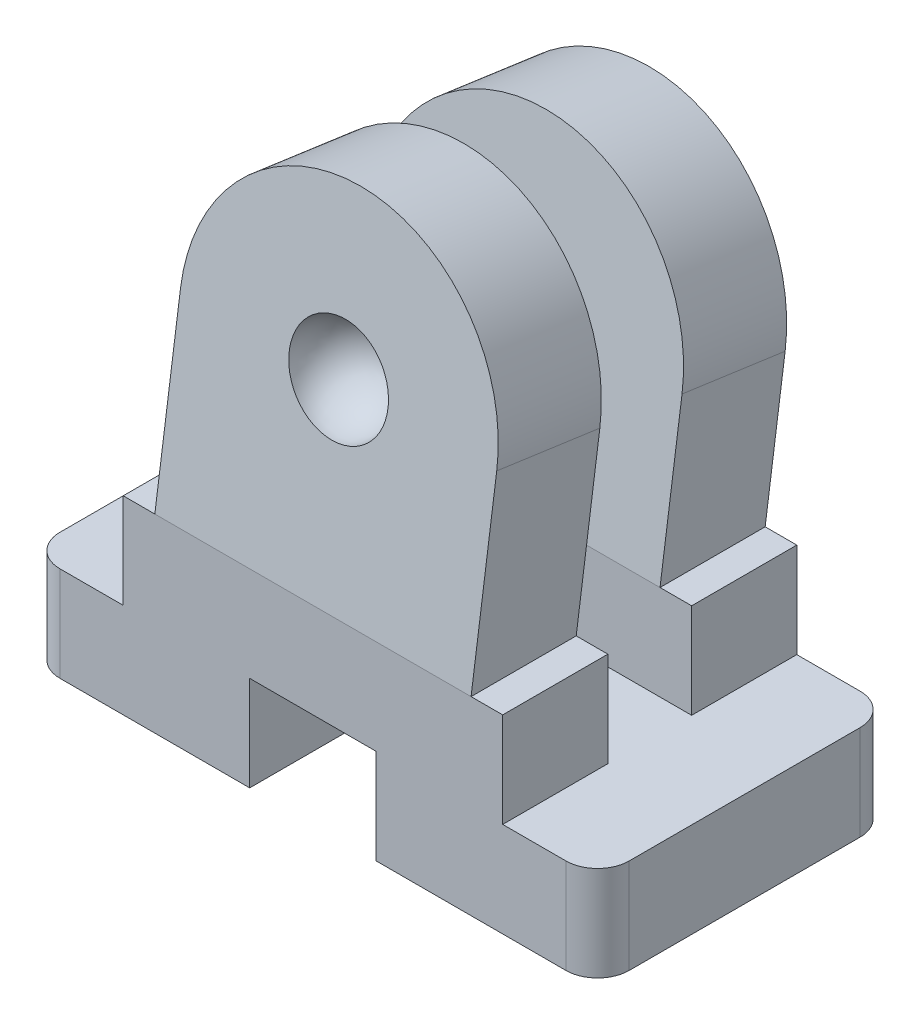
ISO-10303-21;
HEADER;
FILE_DESCRIPTION(('STEP AP214'),'2;1');
FILE_NAME('part.step','',(''),(''),'','','');
FILE_SCHEMA(('AUTOMOTIVE_DESIGN { 1 0 10303 214 1 1 1 1 }'));
ENDSEC;
DATA;
#1=APPLICATION_CONTEXT('core data for automotive mechanical design processes');
#2=APPLICATION_PROTOCOL_DEFINITION('international standard','automotive_design',2000,#1);
#3=PRODUCT_CONTEXT('',#1,'mechanical');
#4=PRODUCT('Part','Part','',(#3));
#5=PRODUCT_RELATED_PRODUCT_CATEGORY('part','',(#4));
#6=PRODUCT_DEFINITION_FORMATION('','',#4);
#7=PRODUCT_DEFINITION_CONTEXT('part definition',#1,'design');
#8=PRODUCT_DEFINITION('design','',#6,#7);
#9=PRODUCT_DEFINITION_SHAPE('','',#8);
#10=(LENGTH_UNIT() NAMED_UNIT(*) SI_UNIT(.MILLI.,.METRE.));
#11=(NAMED_UNIT(*) PLANE_ANGLE_UNIT() SI_UNIT($,.RADIAN.));
#12=(NAMED_UNIT(*) SI_UNIT($,.STERADIAN.) SOLID_ANGLE_UNIT());
#13=UNCERTAINTY_MEASURE_WITH_UNIT(LENGTH_MEASURE(1.E-05),#10,'distance_accuracy_value','');
#14=(GEOMETRIC_REPRESENTATION_CONTEXT(3) GLOBAL_UNCERTAINTY_ASSIGNED_CONTEXT((#13)) GLOBAL_UNIT_ASSIGNED_CONTEXT((#10,
#11,#12)) REPRESENTATION_CONTEXT('',''));
#15=CARTESIAN_POINT('',(0.,0.,0.));
#16=DIRECTION('',(0.,0.,1.));
#17=DIRECTION('',(1.,0.,0.));
#18=AXIS2_PLACEMENT_3D('',#15,#16,#17);
#19=CARTESIAN_POINT('',(0.,3.,0.));
#20=DIRECTION('',(0.,1.,0.));
#21=DIRECTION('',(0.,0.,1.));
#22=AXIS2_PLACEMENT_3D('',#19,#20,#21);
#23=PLANE('',#22);
#24=DIRECTION('',(0.,0.,-1.));
#25=VECTOR('',#24,1.);
#26=CARTESIAN_POINT('',(9.,3.,-4.65));
#27=LINE('',#26,#25);
#28=CARTESIAN_POINT('',(9.,3.,3.65));
#29=VERTEX_POINT('',#28);
#30=CARTESIAN_POINT('',(9.,3.,-3.65));
#31=VERTEX_POINT('',#30);
#32=EDGE_CURVE('E414',#29,#31,#27,.T.);
#33=ORIENTED_EDGE('',*,*,#32,.T.);
#34=CARTESIAN_POINT('',(8.,3.,-3.65));
#35=DIRECTION('',(0.,1.,0.));
#36=DIRECTION('',(0.,0.,1.));
#37=AXIS2_PLACEMENT_3D('',#34,#35,#36);
#38=CIRCLE('',#37,1.);
#39=CARTESIAN_POINT('',(8.,3.,-4.65));
#40=VERTEX_POINT('',#39);
#41=EDGE_CURVE('E12',#31,#40,#38,.T.);
#42=ORIENTED_EDGE('',*,*,#41,.T.);
#43=DIRECTION('',(-1.,0.,0.));
#44=VECTOR('',#43,1.);
#45=CARTESIAN_POINT('',(-9.,3.,-4.65));
#46=LINE('',#45,#44);
#47=CARTESIAN_POINT('',(6.,3.,-4.65));
#48=VERTEX_POINT('',#47);
#49=EDGE_CURVE('E424',#40,#48,#46,.T.);
#50=ORIENTED_EDGE('',*,*,#49,.T.);
#51=DIRECTION('',(0.,0.,-1.));
#52=VECTOR('',#51,1.);
#53=CARTESIAN_POINT('',(6.,3.,-4.65));
#54=LINE('',#53,#52);
#55=CARTESIAN_POINT('',(6.,3.,-1.325));
#56=VERTEX_POINT('',#55);
#57=EDGE_CURVE('E388',#56,#48,#54,.T.);
#58=ORIENTED_EDGE('',*,*,#57,.F.);
#59=DIRECTION('',(1.,0.,0.));
#60=VECTOR('',#59,1.);
#61=CARTESIAN_POINT('',(-6.,3.,-1.325));
#62=LINE('',#61,#60);
#63=CARTESIAN_POINT('',(2.,3.,-1.325));
#64=VERTEX_POINT('',#63);
#65=EDGE_CURVE('E397',#64,#56,#62,.T.);
#66=ORIENTED_EDGE('',*,*,#65,.F.);
#67=DIRECTION('',(0.,0.,1.));
#68=VECTOR('',#67,1.);
#69=CARTESIAN_POINT('',(2.,3.,4.65));
#70=LINE('',#69,#68);
#71=CARTESIAN_POINT('',(2.,3.,1.325));
#72=VERTEX_POINT('',#71);
#73=EDGE_CURVE('E242',#64,#72,#70,.T.);
#74=ORIENTED_EDGE('',*,*,#73,.T.);
#75=DIRECTION('',(-1.,0.,0.));
#76=VECTOR('',#75,1.);
#77=CARTESIAN_POINT('',(-6.,3.,1.325));
#78=LINE('',#77,#76);
#79=CARTESIAN_POINT('',(6.,3.,1.325));
#80=VERTEX_POINT('',#79);
#81=EDGE_CURVE('E516',#80,#72,#78,.T.);
#82=ORIENTED_EDGE('',*,*,#81,.F.);
#83=DIRECTION('',(0.,0.,-1.));
#84=VECTOR('',#83,1.);
#85=CARTESIAN_POINT('',(6.,3.,4.65));
#86=LINE('',#85,#84);
#87=CARTESIAN_POINT('',(6.,3.,4.65));
#88=VERTEX_POINT('',#87);
#89=EDGE_CURVE('E521',#88,#80,#86,.T.);
#90=ORIENTED_EDGE('',*,*,#89,.F.);
#91=DIRECTION('',(1.,0.,0.));
#92=VECTOR('',#91,1.);
#93=CARTESIAN_POINT('',(-9.,3.,4.65));
#94=LINE('',#93,#92);
#95=CARTESIAN_POINT('',(8.,3.,4.65));
#96=VERTEX_POINT('',#95);
#97=EDGE_CURVE('E411',#88,#96,#94,.T.);
#98=ORIENTED_EDGE('',*,*,#97,.T.);
#99=CARTESIAN_POINT('',(8.,3.,3.65));
#100=DIRECTION('',(0.,1.,0.));
#101=DIRECTION('',(0.,0.,1.));
#102=AXIS2_PLACEMENT_3D('',#99,#100,#101);
#103=CIRCLE('',#102,1.);
#104=EDGE_CURVE('E45',#96,#29,#103,.T.);
#105=ORIENTED_EDGE('',*,*,#104,.T.);
#106=EDGE_LOOP('',(#33,#42,#50,#58,#66,#74,#82,#90,#98,#105));
#107=FACE_BOUND('',#106,.T.);
#108=ADVANCED_FACE('F37',(#107),#23,.T.);
#109=CARTESIAN_POINT('',(0.,0.,0.));
#110=DIRECTION('',(0.,1.,0.));
#111=DIRECTION('',(0.,0.,1.));
#112=AXIS2_PLACEMENT_3D('',#109,#110,#111);
#113=PLANE('',#112);
#114=DIRECTION('',(-1.,0.,0.));
#115=VECTOR('',#114,1.);
#116=CARTESIAN_POINT('',(-9.,0.,-4.65));
#117=LINE('',#116,#115);
#118=CARTESIAN_POINT('',(8.,0.,-4.65));
#119=VERTEX_POINT('',#118);
#120=CARTESIAN_POINT('',(2.,0.,-4.65));
#121=VERTEX_POINT('',#120);
#122=EDGE_CURVE('E262',#119,#121,#117,.T.);
#123=ORIENTED_EDGE('',*,*,#122,.F.);
#124=CARTESIAN_POINT('',(8.,0.,-3.65));
#125=DIRECTION('',(0.,1.,0.));
#126=DIRECTION('',(0.,0.,1.));
#127=AXIS2_PLACEMENT_3D('',#124,#125,#126);
#128=CIRCLE('',#127,1.);
#129=CARTESIAN_POINT('',(9.,0.,-3.65));
#130=VERTEX_POINT('',#129);
#131=EDGE_CURVE('E444',#119,#130,#128,.F.);
#132=ORIENTED_EDGE('',*,*,#131,.T.);
#133=DIRECTION('',(0.,0.,-1.));
#134=VECTOR('',#133,1.);
#135=CARTESIAN_POINT('',(9.,0.,-4.65));
#136=LINE('',#135,#134);
#137=CARTESIAN_POINT('',(9.,0.,3.65));
#138=VERTEX_POINT('',#137);
#139=EDGE_CURVE('E452',#138,#130,#136,.T.);
#140=ORIENTED_EDGE('',*,*,#139,.F.);
#141=CARTESIAN_POINT('',(8.,0.,3.65));
#142=DIRECTION('',(0.,1.,0.));
#143=DIRECTION('',(0.,0.,1.));
#144=AXIS2_PLACEMENT_3D('',#141,#142,#143);
#145=CIRCLE('',#144,1.);
#146=CARTESIAN_POINT('',(8.,0.,4.65));
#147=VERTEX_POINT('',#146);
#148=EDGE_CURVE('E442',#138,#147,#145,.F.);
#149=ORIENTED_EDGE('',*,*,#148,.T.);
#150=DIRECTION('',(1.,0.,0.));
#151=VECTOR('',#150,1.);
#152=CARTESIAN_POINT('',(-9.,0.,4.65));
#153=LINE('',#152,#151);
#154=CARTESIAN_POINT('',(2.,0.,4.65));
#155=VERTEX_POINT('',#154);
#156=EDGE_CURVE('E461',#155,#147,#153,.T.);
#157=ORIENTED_EDGE('',*,*,#156,.F.);
#158=DIRECTION('',(0.,0.,1.));
#159=VECTOR('',#158,1.);
#160=CARTESIAN_POINT('',(2.,0.,4.65));
#161=LINE('',#160,#159);
#162=EDGE_CURVE('E256',#121,#155,#161,.T.);
#163=ORIENTED_EDGE('',*,*,#162,.F.);
#164=EDGE_LOOP('',(#123,#132,#140,#149,#157,#163));
#165=FACE_BOUND('',#164,.T.);
#166=ADVANCED_FACE('F455',(#165),#113,.F.);
#167=CARTESIAN_POINT('',(-5.,0.757071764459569,5.38684551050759));
#168=DIRECTION('',(0.,-0.139173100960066,-0.99026806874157));
#169=DIRECTION('',(0.,0.99026806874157,-0.139173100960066));
#170=AXIS2_PLACEMENT_3D('',#167,#168,#169);
#171=PLANE('',#170);
#172=CARTESIAN_POINT('',(0.,11.7748069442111,3.8384038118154));
#173=DIRECTION('',(0.,0.139173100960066,0.99026806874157));
#174=DIRECTION('',(0.,-0.99026806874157,0.139173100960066));
#175=AXIS2_PLACEMENT_3D('',#172,#173,#174);
#176=CIRCLE('',#175,1.5625);
#177=CARTESIAN_POINT('',(0.,10.2275130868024,4.0558617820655));
#178=VERTEX_POINT('',#177);
#179=EDGE_CURVE('E287',#178,#178,#176,.T.);
#180=ORIENTED_EDGE('',*,*,#179,.F.);
#181=EDGE_LOOP('',(#180));
#182=FACE_BOUND('',#181,.T.);
#183=DIRECTION('',(0.,0.99026806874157,-0.139173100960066));
#184=VECTOR('',#183,1.);
#185=CARTESIAN_POINT('',(5.,0.757071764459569,5.38684551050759));
#186=LINE('',#185,#184);
#187=CARTESIAN_POINT('',(5.,6.,4.65));
#188=VERTEX_POINT('',#187);
#189=CARTESIAN_POINT('',(5.,11.7748069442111,3.8384038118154));
#190=VERTEX_POINT('',#189);
#191=EDGE_CURVE('E326',#188,#190,#186,.T.);
#192=ORIENTED_EDGE('',*,*,#191,.T.);
#193=CARTESIAN_POINT('',(0.,11.7748069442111,3.8384038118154));
#194=DIRECTION('',(0.,0.139173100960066,0.99026806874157));
#195=DIRECTION('',(0.,-0.99026806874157,0.139173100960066));
#196=AXIS2_PLACEMENT_3D('',#193,#194,#195);
#197=CIRCLE('',#196,5.);
#198=CARTESIAN_POINT('',(-5.,11.7748069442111,3.8384038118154));
#199=VERTEX_POINT('',#198);
#200=EDGE_CURVE('E276',#190,#199,#197,.T.);
#201=ORIENTED_EDGE('',*,*,#200,.T.);
#202=DIRECTION('',(0.,0.99026806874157,-0.139173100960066));
#203=VECTOR('',#202,1.);
#204=CARTESIAN_POINT('',(-5.,0.757071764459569,5.38684551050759));
#205=LINE('',#204,#203);
#206=CARTESIAN_POINT('',(-5.,6.,4.65));
#207=VERTEX_POINT('',#206);
#208=EDGE_CURVE('E556',#207,#199,#205,.T.);
#209=ORIENTED_EDGE('',*,*,#208,.F.);
#210=DIRECTION('',(1.,0.,0.));
#211=VECTOR('',#210,1.);
#212=CARTESIAN_POINT('',(-5.,6.,4.65));
#213=LINE('',#212,#211);
#214=EDGE_CURVE('E523',#207,#188,#213,.T.);
#215=ORIENTED_EDGE('',*,*,#214,.T.);
#216=EDGE_LOOP('',(#192,#201,#209,#215));
#217=FACE_BOUND('',#216,.T.);
#218=ADVANCED_FACE('F631',(#182,#217),#171,.F.);
#219=CARTESIAN_POINT('',(-5.,0.298824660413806,2.12624794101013));
#220=DIRECTION('',(0.,0.139173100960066,0.99026806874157));
#221=DIRECTION('',(0.,-0.99026806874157,0.139173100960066));
#222=AXIS2_PLACEMENT_3D('',#219,#220,#221);
#223=PLANE('',#222);
#224=CARTESIAN_POINT('',(0.,11.3165598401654,0.577806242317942));
#225=DIRECTION('',(0.,0.139173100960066,0.99026806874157));
#226=DIRECTION('',(0.,-0.99026806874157,0.139173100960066));
#227=AXIS2_PLACEMENT_3D('',#224,#225,#226);
#228=CIRCLE('',#227,5.);
#229=CARTESIAN_POINT('',(5.,11.3165598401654,0.577806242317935));
#230=VERTEX_POINT('',#229);
#231=CARTESIAN_POINT('',(-5.,11.3165598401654,0.57780624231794));
#232=VERTEX_POINT('',#231);
#233=EDGE_CURVE('E285',#230,#232,#228,.T.);
#234=ORIENTED_EDGE('',*,*,#233,.F.);
#235=DIRECTION('',(0.,-0.99026806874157,0.139173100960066));
#236=VECTOR('',#235,1.);
#237=CARTESIAN_POINT('',(5.,0.298824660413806,2.12624794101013));
#238=LINE('',#237,#236);
#239=CARTESIAN_POINT('',(5.,6.,1.325));
#240=VERTEX_POINT('',#239);
#241=EDGE_CURVE('E323',#230,#240,#238,.T.);
#242=ORIENTED_EDGE('',*,*,#241,.T.);
#243=DIRECTION('',(1.,0.,0.));
#244=VECTOR('',#243,1.);
#245=CARTESIAN_POINT('',(-5.,6.,1.325));
#246=LINE('',#245,#244);
#247=CARTESIAN_POINT('',(-5.,6.,1.325));
#248=VERTEX_POINT('',#247);
#249=EDGE_CURVE('E551',#248,#240,#246,.T.);
#250=ORIENTED_EDGE('',*,*,#249,.F.);
#251=DIRECTION('',(0.,-0.99026806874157,0.139173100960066));
#252=VECTOR('',#251,1.);
#253=CARTESIAN_POINT('',(-5.,0.298824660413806,2.12624794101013));
#254=LINE('',#253,#252);
#255=EDGE_CURVE('E315',#232,#248,#254,.T.);
#256=ORIENTED_EDGE('',*,*,#255,.F.);
#257=EDGE_LOOP('',(#234,#242,#250,#256));
#258=FACE_BOUND('',#257,.T.);
#259=ADVANCED_FACE('F577',(#258),#223,.F.);
#260=CARTESIAN_POINT('',(-5.,-0.0663948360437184,-0.472423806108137));
#261=DIRECTION('',(0.,-0.139173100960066,-0.99026806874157));
#262=DIRECTION('',(0.,0.99026806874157,-0.139173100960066));
#263=AXIS2_PLACEMENT_3D('',#260,#261,#262);
#264=PLANE('',#263);
#265=DIRECTION('',(0.,0.99026806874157,-0.139173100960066));
#266=VECTOR('',#265,1.);
#267=CARTESIAN_POINT('',(5.,-0.0663948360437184,-0.472423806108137));
#268=LINE('',#267,#266);
#269=CARTESIAN_POINT('',(5.,6.,-1.325));
#270=VERTEX_POINT('',#269);
#271=CARTESIAN_POINT('',(5.,10.9513403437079,-2.02086550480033));
#272=VERTEX_POINT('',#271);
#273=EDGE_CURVE('E301',#270,#272,#268,.T.);
#274=ORIENTED_EDGE('',*,*,#273,.T.);
#275=CARTESIAN_POINT('',(0.,10.9513403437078,-2.02086550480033));
#276=DIRECTION('',(0.,-0.139173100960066,-0.99026806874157));
#277=DIRECTION('',(0.,0.99026806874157,-0.139173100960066));
#278=AXIS2_PLACEMENT_3D('',#275,#276,#277);
#279=CIRCLE('',#278,5.);
#280=CARTESIAN_POINT('',(-5.,10.9513403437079,-2.02086550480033));
#281=VERTEX_POINT('',#280);
#282=EDGE_CURVE('E283',#281,#272,#279,.T.);
#283=ORIENTED_EDGE('',*,*,#282,.F.);
#284=DIRECTION('',(0.,0.99026806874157,-0.139173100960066));
#285=VECTOR('',#284,1.);
#286=CARTESIAN_POINT('',(-5.,-0.0663948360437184,-0.472423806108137));
#287=LINE('',#286,#285);
#288=CARTESIAN_POINT('',(-5.,6.,-1.325));
#289=VERTEX_POINT('',#288);
#290=EDGE_CURVE('E314',#289,#281,#287,.T.);
#291=ORIENTED_EDGE('',*,*,#290,.F.);
#292=DIRECTION('',(1.,0.,0.));
#293=VECTOR('',#292,1.);
#294=CARTESIAN_POINT('',(-5.,6.,-1.325));
#295=LINE('',#294,#293);
#296=EDGE_CURVE('E587',#289,#270,#295,.T.);
#297=ORIENTED_EDGE('',*,*,#296,.T.);
#298=EDGE_LOOP('',(#274,#283,#291,#297));
#299=FACE_BOUND('',#298,.T.);
#300=ADVANCED_FACE('F606',(#299),#264,.F.);
#301=CARTESIAN_POINT('',(-5.,-0.52464194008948,-3.73302137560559));
#302=DIRECTION('',(0.,0.139173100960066,0.99026806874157));
#303=DIRECTION('',(0.,-0.99026806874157,0.139173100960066));
#304=AXIS2_PLACEMENT_3D('',#301,#302,#303);
#305=PLANE('',#304);
#306=CARTESIAN_POINT('',(0.,10.4930932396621,-5.28146307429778));
#307=DIRECTION('',(0.,0.139173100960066,0.99026806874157));
#308=DIRECTION('',(0.,-0.99026806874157,0.139173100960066));
#309=AXIS2_PLACEMENT_3D('',#306,#307,#308);
#310=CIRCLE('',#309,1.5625);
#311=CARTESIAN_POINT('',(0.,8.94579938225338,-5.06400510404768));
#312=VERTEX_POINT('',#311);
#313=EDGE_CURVE('E290',#312,#312,#310,.T.);
#314=ORIENTED_EDGE('',*,*,#313,.T.);
#315=EDGE_LOOP('',(#314));
#316=FACE_BOUND('',#315,.T.);
#317=CARTESIAN_POINT('',(0.,10.4930932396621,-5.28146307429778));
#318=DIRECTION('',(0.,0.139173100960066,0.99026806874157));
#319=DIRECTION('',(0.,-0.99026806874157,0.139173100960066));
#320=AXIS2_PLACEMENT_3D('',#317,#318,#319);
#321=CIRCLE('',#320,5.);
#322=CARTESIAN_POINT('',(5.,10.4930932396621,-5.28146307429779));
#323=VERTEX_POINT('',#322);
#324=CARTESIAN_POINT('',(-5.,10.4930932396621,-5.28146307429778));
#325=VERTEX_POINT('',#324);
#326=EDGE_CURVE('E281',#323,#325,#321,.T.);
#327=ORIENTED_EDGE('',*,*,#326,.F.);
#328=DIRECTION('',(0.,-0.99026806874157,0.139173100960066));
#329=VECTOR('',#328,1.);
#330=CARTESIAN_POINT('',(5.,-0.52464194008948,-3.73302137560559));
#331=LINE('',#330,#329);
#332=CARTESIAN_POINT('',(5.,6.,-4.65));
#333=VERTEX_POINT('',#332);
#334=EDGE_CURVE('E300',#323,#333,#331,.T.);
#335=ORIENTED_EDGE('',*,*,#334,.T.);
#336=DIRECTION('',(1.,0.,0.));
#337=VECTOR('',#336,1.);
#338=CARTESIAN_POINT('',(-5.,6.,-4.65));
#339=LINE('',#338,#337);
#340=CARTESIAN_POINT('',(-5.,6.,-4.65));
#341=VERTEX_POINT('',#340);
#342=EDGE_CURVE('E586',#341,#333,#339,.T.);
#343=ORIENTED_EDGE('',*,*,#342,.F.);
#344=DIRECTION('',(0.,-0.99026806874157,0.139173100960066));
#345=VECTOR('',#344,1.);
#346=CARTESIAN_POINT('',(-5.,-0.52464194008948,-3.73302137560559));
#347=LINE('',#346,#345);
#348=EDGE_CURVE('E590',#325,#341,#347,.T.);
#349=ORIENTED_EDGE('',*,*,#348,.F.);
#350=EDGE_LOOP('',(#327,#335,#343,#349));
#351=FACE_BOUND('',#350,.T.);
#352=ADVANCED_FACE('F703',(#316,#351),#305,.F.);
#353=CARTESIAN_POINT('',(5.,0.,0.));
#354=DIRECTION('',(1.,0.,0.));
#355=DIRECTION('',(0.,0.,-1.));
#356=AXIS2_PLACEMENT_3D('',#353,#354,#355);
#357=PLANE('',#356);
#358=ORIENTED_EDGE('',*,*,#241,.F.);
#359=DIRECTION('',(0.,0.139173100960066,0.99026806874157));
#360=VECTOR('',#359,1.);
#361=CARTESIAN_POINT('',(5.,10.1939442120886,-7.41001900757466));
#362=LINE('',#361,#360);
#363=EDGE_CURVE('E273',#230,#190,#362,.T.);
#364=ORIENTED_EDGE('',*,*,#363,.T.);
#365=ORIENTED_EDGE('',*,*,#191,.F.);
#366=DIRECTION('',(0.,0.,1.));
#367=VECTOR('',#366,1.);
#368=CARTESIAN_POINT('',(5.,6.,0.));
#369=LINE('',#368,#367);
#370=EDGE_CURVE('E327',#240,#188,#369,.T.);
#371=ORIENTED_EDGE('',*,*,#370,.F.);
#372=EDGE_LOOP('',(#358,#364,#365,#371));
#373=FACE_BOUND('',#372,.T.);
#374=ADVANCED_FACE('F582',(#373),#357,.T.);
#375=CARTESIAN_POINT('',(5.,0.,0.));
#376=DIRECTION('',(1.,0.,0.));
#377=DIRECTION('',(0.,0.,-1.));
#378=AXIS2_PLACEMENT_3D('',#375,#376,#377);
#379=PLANE('',#378);
#380=ORIENTED_EDGE('',*,*,#334,.F.);
#381=DIRECTION('',(0.,0.139173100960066,0.99026806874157));
#382=VECTOR('',#381,1.);
#383=CARTESIAN_POINT('',(5.,10.1939442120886,-7.41001900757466));
#384=LINE('',#383,#382);
#385=EDGE_CURVE('E318',#323,#272,#384,.T.);
#386=ORIENTED_EDGE('',*,*,#385,.T.);
#387=ORIENTED_EDGE('',*,*,#273,.F.);
#388=DIRECTION('',(0.,0.,-1.));
#389=VECTOR('',#388,1.);
#390=CARTESIAN_POINT('',(5.,6.,0.));
#391=LINE('',#390,#389);
#392=EDGE_CURVE('E296',#270,#333,#391,.T.);
#393=ORIENTED_EDGE('',*,*,#392,.T.);
#394=EDGE_LOOP('',(#380,#386,#387,#393));
#395=FACE_BOUND('',#394,.T.);
#396=ADVANCED_FACE('F617',(#395),#379,.T.);
#397=CARTESIAN_POINT('',(-5.,0.,0.));
#398=DIRECTION('',(1.,0.,0.));
#399=DIRECTION('',(0.,0.,-1.));
#400=AXIS2_PLACEMENT_3D('',#397,#398,#399);
#401=PLANE('',#400);
#402=DIRECTION('',(0.,0.139173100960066,0.99026806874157));
#403=VECTOR('',#402,1.);
#404=CARTESIAN_POINT('',(-5.,10.1939442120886,-7.41001900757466));
#405=LINE('',#404,#403);
#406=EDGE_CURVE('E279',#232,#199,#405,.T.);
#407=ORIENTED_EDGE('',*,*,#406,.F.);
#408=ORIENTED_EDGE('',*,*,#255,.T.);
#409=DIRECTION('',(0.,0.,1.));
#410=VECTOR('',#409,1.);
#411=CARTESIAN_POINT('',(-5.,6.,0.));
#412=LINE('',#411,#410);
#413=EDGE_CURVE('E335',#248,#207,#412,.T.);
#414=ORIENTED_EDGE('',*,*,#413,.T.);
#415=ORIENTED_EDGE('',*,*,#208,.T.);
#416=EDGE_LOOP('',(#407,#408,#414,#415));
#417=FACE_BOUND('',#416,.T.);
#418=ADVANCED_FACE('F568',(#417),#401,.F.);
#419=CARTESIAN_POINT('',(-5.,0.,0.));
#420=DIRECTION('',(1.,0.,0.));
#421=DIRECTION('',(0.,0.,-1.));
#422=AXIS2_PLACEMENT_3D('',#419,#420,#421);
#423=PLANE('',#422);
#424=DIRECTION('',(0.,0.139173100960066,0.99026806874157));
#425=VECTOR('',#424,1.);
#426=CARTESIAN_POINT('',(-5.,10.1939442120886,-7.41001900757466));
#427=LINE('',#426,#425);
#428=EDGE_CURVE('E322',#325,#281,#427,.T.);
#429=ORIENTED_EDGE('',*,*,#428,.F.);
#430=ORIENTED_EDGE('',*,*,#348,.T.);
#431=DIRECTION('',(0.,0.,-1.));
#432=VECTOR('',#431,1.);
#433=CARTESIAN_POINT('',(-5.,6.,0.));
#434=LINE('',#433,#432);
#435=EDGE_CURVE('E378',#289,#341,#434,.T.);
#436=ORIENTED_EDGE('',*,*,#435,.F.);
#437=ORIENTED_EDGE('',*,*,#290,.T.);
#438=EDGE_LOOP('',(#429,#430,#436,#437));
#439=FACE_BOUND('',#438,.T.);
#440=ADVANCED_FACE('F608',(#439),#423,.F.);
#441=CARTESIAN_POINT('',(0.,6.,0.));
#442=DIRECTION('',(0.,1.,0.));
#443=DIRECTION('',(0.,0.,1.));
#444=AXIS2_PLACEMENT_3D('',#441,#442,#443);
#445=PLANE('',#444);
#446=DIRECTION('',(1.,0.,0.));
#447=VECTOR('',#446,1.);
#448=CARTESIAN_POINT('',(-6.,6.,-1.325));
#449=LINE('',#448,#447);
#450=CARTESIAN_POINT('',(-6.,6.,-1.325));
#451=VERTEX_POINT('',#450);
#452=EDGE_CURVE('E338',#451,#289,#449,.T.);
#453=ORIENTED_EDGE('',*,*,#452,.T.);
#454=ORIENTED_EDGE('',*,*,#435,.T.);
#455=DIRECTION('',(-1.,0.,0.));
#456=VECTOR('',#455,1.);
#457=CARTESIAN_POINT('',(-6.,6.,-4.65));
#458=LINE('',#457,#456);
#459=CARTESIAN_POINT('',(-6.,6.,-4.65));
#460=VERTEX_POINT('',#459);
#461=EDGE_CURVE('E352',#341,#460,#458,.T.);
#462=ORIENTED_EDGE('',*,*,#461,.T.);
#463=DIRECTION('',(0.,0.,1.));
#464=VECTOR('',#463,1.);
#465=CARTESIAN_POINT('',(-6.,6.,-4.65));
#466=LINE('',#465,#464);
#467=EDGE_CURVE('E348',#460,#451,#466,.T.);
#468=ORIENTED_EDGE('',*,*,#467,.T.);
#469=EDGE_LOOP('',(#453,#454,#462,#468));
#470=FACE_BOUND('',#469,.T.);
#471=ADVANCED_FACE('F374',(#470),#445,.T.);
#472=CARTESIAN_POINT('',(0.,6.,0.));
#473=DIRECTION('',(0.,1.,0.));
#474=DIRECTION('',(0.,0.,1.));
#475=AXIS2_PLACEMENT_3D('',#472,#473,#474);
#476=PLANE('',#475);
#477=DIRECTION('',(-1.,0.,0.));
#478=VECTOR('',#477,1.);
#479=CARTESIAN_POINT('',(-6.,6.,1.325));
#480=LINE('',#479,#478);
#481=CARTESIAN_POINT('',(6.,6.,1.325));
#482=VERTEX_POINT('',#481);
#483=EDGE_CURVE('E525',#482,#240,#480,.T.);
#484=ORIENTED_EDGE('',*,*,#483,.T.);
#485=ORIENTED_EDGE('',*,*,#370,.T.);
#486=DIRECTION('',(1.,0.,0.));
#487=VECTOR('',#486,1.);
#488=CARTESIAN_POINT('',(-6.,6.,4.65));
#489=LINE('',#488,#487);
#490=CARTESIAN_POINT('',(6.,6.,4.65));
#491=VERTEX_POINT('',#490);
#492=EDGE_CURVE('E515',#188,#491,#489,.T.);
#493=ORIENTED_EDGE('',*,*,#492,.T.);
#494=DIRECTION('',(0.,0.,-1.));
#495=VECTOR('',#494,1.);
#496=CARTESIAN_POINT('',(6.,6.,4.65));
#497=LINE('',#496,#495);
#498=EDGE_CURVE('E528',#491,#482,#497,.T.);
#499=ORIENTED_EDGE('',*,*,#498,.T.);
#500=EDGE_LOOP('',(#484,#485,#493,#499));
#501=FACE_BOUND('',#500,.T.);
#502=ADVANCED_FACE('F635',(#501),#476,.T.);
#503=CARTESIAN_POINT('',(-6.,3.,-4.65));
#504=VERTEX_POINT('',#503);
#505=CARTESIAN_POINT('',(-8.,3.,-4.65));
#506=VERTEX_POINT('',#505);
#507=EDGE_CURVE('E382',#504,#506,#46,.T.);
#508=ORIENTED_EDGE('',*,*,#507,.T.);
#509=CARTESIAN_POINT('',(-8.,3.,-3.65));
#510=DIRECTION('',(0.,1.,0.));
#511=DIRECTION('',(0.,0.,1.));
#512=AXIS2_PLACEMENT_3D('',#509,#510,#511);
#513=CIRCLE('',#512,1.);
#514=CARTESIAN_POINT('',(-9.,3.,-3.65));
#515=VERTEX_POINT('',#514);
#516=EDGE_CURVE('E435',#506,#515,#513,.T.);
#517=ORIENTED_EDGE('',*,*,#516,.T.);
#518=DIRECTION('',(0.,0.,1.));
#519=VECTOR('',#518,1.);
#520=CARTESIAN_POINT('',(-9.,3.,-4.65));
#521=LINE('',#520,#519);
#522=CARTESIAN_POINT('',(-9.,3.,3.65));
#523=VERTEX_POINT('',#522);
#524=EDGE_CURVE('E408',#515,#523,#521,.T.);
#525=ORIENTED_EDGE('',*,*,#524,.T.);
#526=CARTESIAN_POINT('',(-8.,3.,3.65));
#527=DIRECTION('',(0.,1.,0.));
#528=DIRECTION('',(0.,0.,1.));
#529=AXIS2_PLACEMENT_3D('',#526,#527,#528);
#530=CIRCLE('',#529,1.);
#531=CARTESIAN_POINT('',(-8.,3.,4.65));
#532=VERTEX_POINT('',#531);
#533=EDGE_CURVE('E433',#523,#532,#530,.T.);
#534=ORIENTED_EDGE('',*,*,#533,.T.);
#535=CARTESIAN_POINT('',(-6.,3.,4.65));
#536=VERTEX_POINT('',#535);
#537=EDGE_CURVE('E412',#532,#536,#94,.T.);
#538=ORIENTED_EDGE('',*,*,#537,.T.);
#539=DIRECTION('',(0.,0.,1.));
#540=VECTOR('',#539,1.);
#541=CARTESIAN_POINT('',(-6.,3.,4.65));
#542=LINE('',#541,#540);
#543=CARTESIAN_POINT('',(-6.,3.,1.325));
#544=VERTEX_POINT('',#543);
#545=EDGE_CURVE('E512',#544,#536,#542,.T.);
#546=ORIENTED_EDGE('',*,*,#545,.F.);
#547=CARTESIAN_POINT('',(-2.,3.,1.325));
#548=VERTEX_POINT('',#547);
#549=EDGE_CURVE('E520',#548,#544,#78,.T.);
#550=ORIENTED_EDGE('',*,*,#549,.F.);
#551=DIRECTION('',(0.,0.,-1.));
#552=VECTOR('',#551,1.);
#553=CARTESIAN_POINT('',(-2.,3.,4.65));
#554=LINE('',#553,#552);
#555=CARTESIAN_POINT('',(-2.,3.,-1.325));
#556=VERTEX_POINT('',#555);
#557=EDGE_CURVE('E956',#548,#556,#554,.T.);
#558=ORIENTED_EDGE('',*,*,#557,.T.);
#559=CARTESIAN_POINT('',(-6.,3.,-1.325));
#560=VERTEX_POINT('',#559);
#561=EDGE_CURVE('E355',#560,#556,#62,.T.);
#562=ORIENTED_EDGE('',*,*,#561,.F.);
#563=DIRECTION('',(0.,0.,1.));
#564=VECTOR('',#563,1.);
#565=CARTESIAN_POINT('',(-6.,3.,-4.65));
#566=LINE('',#565,#564);
#567=EDGE_CURVE('E492',#504,#560,#566,.T.);
#568=ORIENTED_EDGE('',*,*,#567,.F.);
#569=EDGE_LOOP('',(#508,#517,#525,#534,#538,#546,#550,#558,#562,#568));
#570=FACE_BOUND('',#569,.T.);
#571=ADVANCED_FACE('F491',(#570),#23,.T.);
#572=CARTESIAN_POINT('',(-9.,3.,-4.65));
#573=DIRECTION('',(1.,0.,0.));
#574=DIRECTION('',(0.,0.,-1.));
#575=AXIS2_PLACEMENT_3D('',#572,#573,#574);
#576=PLANE('',#575);
#577=ORIENTED_EDGE('',*,*,#524,.F.);
#578=DIRECTION('',(0.,-1.,0.));
#579=VECTOR('',#578,1.);
#580=CARTESIAN_POINT('',(-9.,3.,-3.65));
#581=LINE('',#580,#579);
#582=CARTESIAN_POINT('',(-9.,0.,-3.65));
#583=VERTEX_POINT('',#582);
#584=EDGE_CURVE('E476',#515,#583,#581,.T.);
#585=ORIENTED_EDGE('',*,*,#584,.T.);
#586=DIRECTION('',(0.,0.,1.));
#587=VECTOR('',#586,1.);
#588=CARTESIAN_POINT('',(-9.,0.,-4.65));
#589=LINE('',#588,#587);
#590=CARTESIAN_POINT('',(-9.,0.,3.65));
#591=VERTEX_POINT('',#590);
#592=EDGE_CURVE('E407',#583,#591,#589,.T.);
#593=ORIENTED_EDGE('',*,*,#592,.T.);
#594=DIRECTION('',(0.,-1.,0.));
#595=VECTOR('',#594,1.);
#596=CARTESIAN_POINT('',(-9.,3.,3.65));
#597=LINE('',#596,#595);
#598=EDGE_CURVE('E321',#591,#523,#597,.F.);
#599=ORIENTED_EDGE('',*,*,#598,.T.);
#600=EDGE_LOOP('',(#577,#585,#593,#599));
#601=FACE_BOUND('',#600,.T.);
#602=ADVANCED_FACE('F474',(#601),#576,.F.);
#603=CARTESIAN_POINT('',(-9.,3.,4.65));
#604=DIRECTION('',(0.,0.,-1.));
#605=DIRECTION('',(-1.,0.,0.));
#606=AXIS2_PLACEMENT_3D('',#603,#604,#605);
#607=PLANE('',#606);
#608=ORIENTED_EDGE('',*,*,#537,.F.);
#609=DIRECTION('',(0.,-1.,0.));
#610=VECTOR('',#609,1.);
#611=CARTESIAN_POINT('',(-8.,3.,4.65));
#612=LINE('',#611,#610);
#613=CARTESIAN_POINT('',(-8.,0.,4.65));
#614=VERTEX_POINT('',#613);
#615=EDGE_CURVE('E439',#532,#614,#612,.T.);
#616=ORIENTED_EDGE('',*,*,#615,.T.);
#617=CARTESIAN_POINT('',(-2.,0.,4.65));
#618=VERTEX_POINT('',#617);
#619=EDGE_CURVE('E459',#614,#618,#153,.T.);
#620=ORIENTED_EDGE('',*,*,#619,.T.);
#621=DIRECTION('',(0.,-1.,0.));
#622=VECTOR('',#621,1.);
#623=CARTESIAN_POINT('',(-2.,13.1237344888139,4.65));
#624=LINE('',#623,#622);
#625=CARTESIAN_POINT('',(-2.,3.,4.65));
#626=VERTEX_POINT('',#625);
#627=EDGE_CURVE('E955',#626,#618,#624,.T.);
#628=ORIENTED_EDGE('',*,*,#627,.F.);
#629=DIRECTION('',(-1.,0.,0.));
#630=VECTOR('',#629,1.);
#631=CARTESIAN_POINT('',(-2.,3.,4.65));
#632=LINE('',#631,#630);
#633=CARTESIAN_POINT('',(2.,3.,4.65));
#634=VERTEX_POINT('',#633);
#635=EDGE_CURVE('E953',#634,#626,#632,.T.);
#636=ORIENTED_EDGE('',*,*,#635,.F.);
#637=DIRECTION('',(0.,-1.,0.));
#638=VECTOR('',#637,1.);
#639=CARTESIAN_POINT('',(2.,13.1237344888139,4.65));
#640=LINE('',#639,#638);
#641=EDGE_CURVE('E245',#634,#155,#640,.T.);
#642=ORIENTED_EDGE('',*,*,#641,.T.);
#643=ORIENTED_EDGE('',*,*,#156,.T.);
#644=DIRECTION('',(0.,-1.,0.));
#645=VECTOR('',#644,1.);
#646=CARTESIAN_POINT('',(8.,3.,4.65));
#647=LINE('',#646,#645);
#648=EDGE_CURVE('E437',#147,#96,#647,.F.);
#649=ORIENTED_EDGE('',*,*,#648,.T.);
#650=ORIENTED_EDGE('',*,*,#97,.F.);
#651=DIRECTION('',(0.,-1.,0.));
#652=VECTOR('',#651,1.);
#653=CARTESIAN_POINT('',(6.,6.,4.65));
#654=LINE('',#653,#652);
#655=EDGE_CURVE('E494',#491,#88,#654,.T.);
#656=ORIENTED_EDGE('',*,*,#655,.F.);
#657=ORIENTED_EDGE('',*,*,#492,.F.);
#658=ORIENTED_EDGE('',*,*,#214,.F.);
#659=CARTESIAN_POINT('',(-6.,6.,4.65));
#660=VERTEX_POINT('',#659);
#661=EDGE_CURVE('E538',#660,#207,#489,.T.);
#662=ORIENTED_EDGE('',*,*,#661,.F.);
#663=DIRECTION('',(0.,-1.,0.));
#664=VECTOR('',#663,1.);
#665=CARTESIAN_POINT('',(-6.,6.,4.65));
#666=LINE('',#665,#664);
#667=EDGE_CURVE('E508',#660,#536,#666,.T.);
#668=ORIENTED_EDGE('',*,*,#667,.T.);
#669=EDGE_LOOP('',(#608,#616,#620,#628,#636,#642,#643,#649,#650,#656,#657,#658,#662,#668));
#670=FACE_BOUND('',#669,.T.);
#671=ADVANCED_FACE('F640',(#670),#607,.F.);
#672=CARTESIAN_POINT('',(9.,3.,-4.65));
#673=DIRECTION('',(-1.,0.,0.));
#674=DIRECTION('',(0.,0.,1.));
#675=AXIS2_PLACEMENT_3D('',#672,#673,#674);
#676=PLANE('',#675);
#677=ORIENTED_EDGE('',*,*,#139,.T.);
#678=DIRECTION('',(0.,-1.,0.));
#679=VECTOR('',#678,1.);
#680=CARTESIAN_POINT('',(9.,3.,-3.65));
#681=LINE('',#680,#679);
#682=EDGE_CURVE('E52',#130,#31,#681,.F.);
#683=ORIENTED_EDGE('',*,*,#682,.T.);
#684=ORIENTED_EDGE('',*,*,#32,.F.);
#685=DIRECTION('',(0.,-1.,0.));
#686=VECTOR('',#685,1.);
#687=CARTESIAN_POINT('',(9.,3.,3.65));
#688=LINE('',#687,#686);
#689=EDGE_CURVE('E446',#29,#138,#688,.T.);
#690=ORIENTED_EDGE('',*,*,#689,.T.);
#691=EDGE_LOOP('',(#677,#683,#684,#690));
#692=FACE_BOUND('',#691,.T.);
#693=ADVANCED_FACE('F451',(#692),#676,.F.);
#694=CARTESIAN_POINT('',(-9.,3.,-4.65));
#695=DIRECTION('',(0.,0.,1.));
#696=DIRECTION('',(1.,0.,0.));
#697=AXIS2_PLACEMENT_3D('',#694,#695,#696);
#698=PLANE('',#697);
#699=CARTESIAN_POINT('',(-2.,0.,-4.65));
#700=VERTEX_POINT('',#699);
#701=CARTESIAN_POINT('',(-8.,0.,-4.65));
#702=VERTEX_POINT('',#701);
#703=EDGE_CURVE('E458',#700,#702,#117,.T.);
#704=ORIENTED_EDGE('',*,*,#703,.T.);
#705=DIRECTION('',(0.,-1.,0.));
#706=VECTOR('',#705,1.);
#707=CARTESIAN_POINT('',(-8.,3.,-4.65));
#708=LINE('',#707,#706);
#709=EDGE_CURVE('E431',#702,#506,#708,.F.);
#710=ORIENTED_EDGE('',*,*,#709,.T.);
#711=ORIENTED_EDGE('',*,*,#507,.F.);
#712=DIRECTION('',(0.,-1.,0.));
#713=VECTOR('',#712,1.);
#714=CARTESIAN_POINT('',(-6.,6.,-4.65));
#715=LINE('',#714,#713);
#716=EDGE_CURVE('E362',#460,#504,#715,.T.);
#717=ORIENTED_EDGE('',*,*,#716,.F.);
#718=ORIENTED_EDGE('',*,*,#461,.F.);
#719=ORIENTED_EDGE('',*,*,#342,.T.);
#720=CARTESIAN_POINT('',(6.,6.,-4.65));
#721=VERTEX_POINT('',#720);
#722=EDGE_CURVE('E360',#721,#333,#458,.T.);
#723=ORIENTED_EDGE('',*,*,#722,.F.);
#724=DIRECTION('',(0.,-1.,0.));
#725=VECTOR('',#724,1.);
#726=CARTESIAN_POINT('',(6.,6.,-4.65));
#727=LINE('',#726,#725);
#728=EDGE_CURVE('E367',#721,#48,#727,.T.);
#729=ORIENTED_EDGE('',*,*,#728,.T.);
#730=ORIENTED_EDGE('',*,*,#49,.F.);
#731=DIRECTION('',(0.,-1.,0.));
#732=VECTOR('',#731,1.);
#733=CARTESIAN_POINT('',(8.,3.,-4.65));
#734=LINE('',#733,#732);
#735=EDGE_CURVE('E429',#40,#119,#734,.T.);
#736=ORIENTED_EDGE('',*,*,#735,.T.);
#737=ORIENTED_EDGE('',*,*,#122,.T.);
#738=DIRECTION('',(0.,-1.,0.));
#739=VECTOR('',#738,1.);
#740=CARTESIAN_POINT('',(2.,13.1237344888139,-4.65));
#741=LINE('',#740,#739);
#742=CARTESIAN_POINT('',(2.,3.,-4.65));
#743=VERTEX_POINT('',#742);
#744=EDGE_CURVE('E238',#743,#121,#741,.T.);
#745=ORIENTED_EDGE('',*,*,#744,.F.);
#746=DIRECTION('',(1.,0.,0.));
#747=VECTOR('',#746,1.);
#748=CARTESIAN_POINT('',(-2.,3.,-4.65));
#749=LINE('',#748,#747);
#750=CARTESIAN_POINT('',(-2.,3.,-4.65));
#751=VERTEX_POINT('',#750);
#752=EDGE_CURVE('E249',#751,#743,#749,.T.);
#753=ORIENTED_EDGE('',*,*,#752,.F.);
#754=DIRECTION('',(0.,-1.,0.));
#755=VECTOR('',#754,1.);
#756=CARTESIAN_POINT('',(-2.,13.1237344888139,-4.65));
#757=LINE('',#756,#755);
#758=EDGE_CURVE('E267',#751,#700,#757,.T.);
#759=ORIENTED_EDGE('',*,*,#758,.T.);
#760=EDGE_LOOP('',(#704,#710,#711,#717,#718,#719,#723,#729,#730,#736,#737,#745,#753,#759));
#761=FACE_BOUND('',#760,.T.);
#762=ADVANCED_FACE('F259',(#761),#698,.F.);
#763=ORIENTED_EDGE('',*,*,#592,.F.);
#764=CARTESIAN_POINT('',(-8.,0.,-3.65));
#765=DIRECTION('',(0.,1.,0.));
#766=DIRECTION('',(0.,0.,1.));
#767=AXIS2_PLACEMENT_3D('',#764,#765,#766);
#768=CIRCLE('',#767,1.);
#769=EDGE_CURVE('E427',#583,#702,#768,.F.);
#770=ORIENTED_EDGE('',*,*,#769,.T.);
#771=ORIENTED_EDGE('',*,*,#703,.F.);
#772=DIRECTION('',(0.,0.,-1.));
#773=VECTOR('',#772,1.);
#774=CARTESIAN_POINT('',(-2.,0.,4.65));
#775=LINE('',#774,#773);
#776=EDGE_CURVE('E960',#618,#700,#775,.T.);
#777=ORIENTED_EDGE('',*,*,#776,.F.);
#778=ORIENTED_EDGE('',*,*,#619,.F.);
#779=CARTESIAN_POINT('',(-8.,0.,3.65));
#780=DIRECTION('',(0.,1.,0.));
#781=DIRECTION('',(0.,0.,1.));
#782=AXIS2_PLACEMENT_3D('',#779,#780,#781);
#783=CIRCLE('',#782,1.);
#784=EDGE_CURVE('E482',#614,#591,#783,.F.);
#785=ORIENTED_EDGE('',*,*,#784,.T.);
#786=EDGE_LOOP('',(#763,#770,#771,#777,#778,#785));
#787=FACE_BOUND('',#786,.T.);
#788=ADVANCED_FACE('F484',(#787),#113,.F.);
#789=CARTESIAN_POINT('',(-6.,6.,-4.65));
#790=DIRECTION('',(1.,0.,0.));
#791=DIRECTION('',(0.,0.,-1.));
#792=AXIS2_PLACEMENT_3D('',#789,#790,#791);
#793=PLANE('',#792);
#794=ORIENTED_EDGE('',*,*,#567,.T.);
#795=DIRECTION('',(0.,-1.,0.));
#796=VECTOR('',#795,1.);
#797=CARTESIAN_POINT('',(-6.,6.,-1.325));
#798=LINE('',#797,#796);
#799=EDGE_CURVE('E387',#451,#560,#798,.T.);
#800=ORIENTED_EDGE('',*,*,#799,.F.);
#801=ORIENTED_EDGE('',*,*,#467,.F.);
#802=ORIENTED_EDGE('',*,*,#716,.T.);
#803=EDGE_LOOP('',(#794,#800,#801,#802));
#804=FACE_BOUND('',#803,.T.);
#805=ADVANCED_FACE('F385',(#804),#793,.F.);
#806=CARTESIAN_POINT('',(-6.,6.,-1.325));
#807=DIRECTION('',(0.,0.,-1.));
#808=DIRECTION('',(-1.,0.,0.));
#809=AXIS2_PLACEMENT_3D('',#806,#807,#808);
#810=PLANE('',#809);
#811=ORIENTED_EDGE('',*,*,#561,.T.);
#812=DIRECTION('',(1.,0.,0.));
#813=VECTOR('',#812,1.);
#814=CARTESIAN_POINT('',(-6.,3.,-1.325));
#815=LINE('',#814,#813);
#816=EDGE_CURVE('E269',#556,#64,#815,.T.);
#817=ORIENTED_EDGE('',*,*,#816,.T.);
#818=ORIENTED_EDGE('',*,*,#65,.T.);
#819=DIRECTION('',(0.,-1.,0.));
#820=VECTOR('',#819,1.);
#821=CARTESIAN_POINT('',(6.,6.,-1.325));
#822=LINE('',#821,#820);
#823=CARTESIAN_POINT('',(6.,6.,-1.325));
#824=VERTEX_POINT('',#823);
#825=EDGE_CURVE('E404',#824,#56,#822,.T.);
#826=ORIENTED_EDGE('',*,*,#825,.F.);
#827=EDGE_CURVE('E343',#270,#824,#449,.T.);
#828=ORIENTED_EDGE('',*,*,#827,.F.);
#829=ORIENTED_EDGE('',*,*,#296,.F.);
#830=ORIENTED_EDGE('',*,*,#452,.F.);
#831=ORIENTED_EDGE('',*,*,#799,.T.);
#832=EDGE_LOOP('',(#811,#817,#818,#826,#828,#829,#830,#831));
#833=FACE_BOUND('',#832,.T.);
#834=ADVANCED_FACE('F613',(#833),#810,.F.);
#835=CARTESIAN_POINT('',(6.,6.,-4.65));
#836=DIRECTION('',(-1.,0.,0.));
#837=DIRECTION('',(0.,0.,1.));
#838=AXIS2_PLACEMENT_3D('',#835,#836,#837);
#839=PLANE('',#838);
#840=ORIENTED_EDGE('',*,*,#57,.T.);
#841=ORIENTED_EDGE('',*,*,#728,.F.);
#842=DIRECTION('',(0.,0.,-1.));
#843=VECTOR('',#842,1.);
#844=CARTESIAN_POINT('',(6.,6.,-4.65));
#845=LINE('',#844,#843);
#846=EDGE_CURVE('E342',#824,#721,#845,.T.);
#847=ORIENTED_EDGE('',*,*,#846,.F.);
#848=ORIENTED_EDGE('',*,*,#825,.T.);
#849=EDGE_LOOP('',(#840,#841,#847,#848));
#850=FACE_BOUND('',#849,.T.);
#851=ADVANCED_FACE('F620',(#850),#839,.F.);
#852=ORIENTED_EDGE('',*,*,#392,.F.);
#853=ORIENTED_EDGE('',*,*,#827,.T.);
#854=ORIENTED_EDGE('',*,*,#846,.T.);
#855=ORIENTED_EDGE('',*,*,#722,.T.);
#856=EDGE_LOOP('',(#852,#853,#854,#855));
#857=FACE_BOUND('',#856,.T.);
#858=ADVANCED_FACE('F618',(#857),#445,.T.);
#859=CARTESIAN_POINT('',(6.,6.,4.65));
#860=DIRECTION('',(-1.,0.,0.));
#861=DIRECTION('',(0.,0.,1.));
#862=AXIS2_PLACEMENT_3D('',#859,#860,#861);
#863=PLANE('',#862);
#864=ORIENTED_EDGE('',*,*,#89,.T.);
#865=DIRECTION('',(0.,-1.,0.));
#866=VECTOR('',#865,1.);
#867=CARTESIAN_POINT('',(6.,6.,1.325));
#868=LINE('',#867,#866);
#869=EDGE_CURVE('E495',#482,#80,#868,.T.);
#870=ORIENTED_EDGE('',*,*,#869,.F.);
#871=ORIENTED_EDGE('',*,*,#498,.F.);
#872=ORIENTED_EDGE('',*,*,#655,.T.);
#873=EDGE_LOOP('',(#864,#870,#871,#872));
#874=FACE_BOUND('',#873,.T.);
#875=ADVANCED_FACE('F661',(#874),#863,.F.);
#876=CARTESIAN_POINT('',(-6.,6.,1.325));
#877=DIRECTION('',(0.,0.,1.));
#878=DIRECTION('',(1.,0.,0.));
#879=AXIS2_PLACEMENT_3D('',#876,#877,#878);
#880=PLANE('',#879);
#881=ORIENTED_EDGE('',*,*,#81,.T.);
#882=EDGE_CURVE('E519',#72,#548,#78,.T.);
#883=ORIENTED_EDGE('',*,*,#882,.T.);
#884=ORIENTED_EDGE('',*,*,#549,.T.);
#885=DIRECTION('',(0.,-1.,0.));
#886=VECTOR('',#885,1.);
#887=CARTESIAN_POINT('',(-6.,6.,1.325));
#888=LINE('',#887,#886);
#889=CARTESIAN_POINT('',(-6.,6.,1.325));
#890=VERTEX_POINT('',#889);
#891=EDGE_CURVE('E503',#890,#544,#888,.T.);
#892=ORIENTED_EDGE('',*,*,#891,.F.);
#893=EDGE_CURVE('E532',#248,#890,#480,.T.);
#894=ORIENTED_EDGE('',*,*,#893,.F.);
#895=ORIENTED_EDGE('',*,*,#249,.T.);
#896=ORIENTED_EDGE('',*,*,#483,.F.);
#897=ORIENTED_EDGE('',*,*,#869,.T.);
#898=EDGE_LOOP('',(#881,#883,#884,#892,#894,#895,#896,#897));
#899=FACE_BOUND('',#898,.T.);
#900=ADVANCED_FACE('F575',(#899),#880,.F.);
#901=CARTESIAN_POINT('',(-6.,6.,4.65));
#902=DIRECTION('',(1.,0.,0.));
#903=DIRECTION('',(0.,0.,-1.));
#904=AXIS2_PLACEMENT_3D('',#901,#902,#903);
#905=PLANE('',#904);
#906=ORIENTED_EDGE('',*,*,#545,.T.);
#907=ORIENTED_EDGE('',*,*,#667,.F.);
#908=DIRECTION('',(0.,0.,1.));
#909=VECTOR('',#908,1.);
#910=CARTESIAN_POINT('',(-6.,6.,4.65));
#911=LINE('',#910,#909);
#912=EDGE_CURVE('E511',#890,#660,#911,.T.);
#913=ORIENTED_EDGE('',*,*,#912,.F.);
#914=ORIENTED_EDGE('',*,*,#891,.T.);
#915=EDGE_LOOP('',(#906,#907,#913,#914));
#916=FACE_BOUND('',#915,.T.);
#917=ADVANCED_FACE('F650',(#916),#905,.F.);
#918=ORIENTED_EDGE('',*,*,#413,.F.);
#919=ORIENTED_EDGE('',*,*,#893,.T.);
#920=ORIENTED_EDGE('',*,*,#912,.T.);
#921=ORIENTED_EDGE('',*,*,#661,.T.);
#922=EDGE_LOOP('',(#918,#919,#920,#921));
#923=FACE_BOUND('',#922,.T.);
#924=ADVANCED_FACE('F571',(#923),#476,.T.);
#925=CARTESIAN_POINT('',(0.,10.1939442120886,-7.41001900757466));
#926=DIRECTION('',(0.,0.139173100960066,0.99026806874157));
#927=DIRECTION('',(0.,-0.99026806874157,0.139173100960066));
#928=AXIS2_PLACEMENT_3D('',#925,#926,#927);
#929=CYLINDRICAL_SURFACE('',#928,5.);
#930=ORIENTED_EDGE('',*,*,#282,.T.);
#931=ORIENTED_EDGE('',*,*,#385,.F.);
#932=ORIENTED_EDGE('',*,*,#326,.T.);
#933=ORIENTED_EDGE('',*,*,#428,.T.);
#934=EDGE_LOOP('',(#930,#931,#932,#933));
#935=FACE_BOUND('',#934,.T.);
#936=ADVANCED_FACE('F600',(#935),#929,.T.);
#937=ORIENTED_EDGE('',*,*,#233,.T.);
#938=ORIENTED_EDGE('',*,*,#406,.T.);
#939=ORIENTED_EDGE('',*,*,#200,.F.);
#940=ORIENTED_EDGE('',*,*,#363,.F.);
#941=EDGE_LOOP('',(#937,#938,#939,#940));
#942=FACE_BOUND('',#941,.T.);
#943=ADVANCED_FACE('F655',(#942),#929,.T.);
#944=CARTESIAN_POINT('',(0.,3.,0.));
#945=DIRECTION('',(0.,1.,0.));
#946=DIRECTION('',(0.,0.,1.));
#947=AXIS2_PLACEMENT_3D('',#944,#945,#946);
#948=PLANE('',#947);
#949=EDGE_CURVE('E252',#556,#751,#554,.T.);
#950=ORIENTED_EDGE('',*,*,#949,.T.);
#951=ORIENTED_EDGE('',*,*,#752,.T.);
#952=EDGE_CURVE('E234',#743,#64,#70,.T.);
#953=ORIENTED_EDGE('',*,*,#952,.T.);
#954=ORIENTED_EDGE('',*,*,#816,.F.);
#955=EDGE_LOOP('',(#950,#951,#953,#954));
#956=FACE_BOUND('',#955,.T.);
#957=ADVANCED_FACE('F250',(#956),#948,.F.);
#958=EDGE_CURVE('E247',#72,#634,#70,.T.);
#959=ORIENTED_EDGE('',*,*,#958,.T.);
#960=ORIENTED_EDGE('',*,*,#635,.T.);
#961=EDGE_CURVE('E270',#626,#548,#554,.T.);
#962=ORIENTED_EDGE('',*,*,#961,.T.);
#963=ORIENTED_EDGE('',*,*,#882,.F.);
#964=EDGE_LOOP('',(#959,#960,#962,#963));
#965=FACE_BOUND('',#964,.T.);
#966=ADVANCED_FACE('F747',(#965),#948,.F.);
#967=CARTESIAN_POINT('',(2.,13.1237344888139,4.65));
#968=DIRECTION('',(1.,0.,0.));
#969=DIRECTION('',(0.,0.,-1.));
#970=AXIS2_PLACEMENT_3D('',#967,#968,#969);
#971=PLANE('',#970);
#972=ORIENTED_EDGE('',*,*,#744,.T.);
#973=ORIENTED_EDGE('',*,*,#162,.T.);
#974=ORIENTED_EDGE('',*,*,#641,.F.);
#975=ORIENTED_EDGE('',*,*,#958,.F.);
#976=ORIENTED_EDGE('',*,*,#73,.F.);
#977=ORIENTED_EDGE('',*,*,#952,.F.);
#978=EDGE_LOOP('',(#972,#973,#974,#975,#976,#977));
#979=FACE_BOUND('',#978,.T.);
#980=ADVANCED_FACE('F236',(#979),#971,.F.);
#981=CARTESIAN_POINT('',(-2.,13.1237344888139,4.65));
#982=DIRECTION('',(-1.,0.,0.));
#983=DIRECTION('',(0.,0.,1.));
#984=AXIS2_PLACEMENT_3D('',#981,#982,#983);
#985=PLANE('',#984);
#986=ORIENTED_EDGE('',*,*,#627,.T.);
#987=ORIENTED_EDGE('',*,*,#776,.T.);
#988=ORIENTED_EDGE('',*,*,#758,.F.);
#989=ORIENTED_EDGE('',*,*,#949,.F.);
#990=ORIENTED_EDGE('',*,*,#557,.F.);
#991=ORIENTED_EDGE('',*,*,#961,.F.);
#992=EDGE_LOOP('',(#986,#987,#988,#989,#990,#991));
#993=FACE_BOUND('',#992,.T.);
#994=ADVANCED_FACE('F685',(#993),#985,.F.);
#995=CARTESIAN_POINT('',(-8.,3.,-3.65));
#996=DIRECTION('',(0.,-1.,0.));
#997=DIRECTION('',(0.,0.,-1.));
#998=AXIS2_PLACEMENT_3D('',#995,#996,#997);
#999=CYLINDRICAL_SURFACE('',#998,1.);
#1000=ORIENTED_EDGE('',*,*,#516,.F.);
#1001=ORIENTED_EDGE('',*,*,#709,.F.);
#1002=ORIENTED_EDGE('',*,*,#769,.F.);
#1003=ORIENTED_EDGE('',*,*,#584,.F.);
#1004=EDGE_LOOP('',(#1000,#1001,#1002,#1003));
#1005=FACE_BOUND('',#1004,.T.);
#1006=ADVANCED_FACE('F489',(#1005),#999,.T.);
#1007=CARTESIAN_POINT('',(-8.,3.,3.65));
#1008=DIRECTION('',(0.,-1.,0.));
#1009=DIRECTION('',(0.,0.,-1.));
#1010=AXIS2_PLACEMENT_3D('',#1007,#1008,#1009);
#1011=CYLINDRICAL_SURFACE('',#1010,1.);
#1012=ORIENTED_EDGE('',*,*,#533,.F.);
#1013=ORIENTED_EDGE('',*,*,#598,.F.);
#1014=ORIENTED_EDGE('',*,*,#784,.F.);
#1015=ORIENTED_EDGE('',*,*,#615,.F.);
#1016=EDGE_LOOP('',(#1012,#1013,#1014,#1015));
#1017=FACE_BOUND('',#1016,.T.);
#1018=ADVANCED_FACE('F480',(#1017),#1011,.T.);
#1019=CARTESIAN_POINT('',(8.,3.,-3.65));
#1020=DIRECTION('',(0.,-1.,0.));
#1021=DIRECTION('',(0.,0.,-1.));
#1022=AXIS2_PLACEMENT_3D('',#1019,#1020,#1021);
#1023=CYLINDRICAL_SURFACE('',#1022,1.);
#1024=ORIENTED_EDGE('',*,*,#41,.F.);
#1025=ORIENTED_EDGE('',*,*,#682,.F.);
#1026=ORIENTED_EDGE('',*,*,#131,.F.);
#1027=ORIENTED_EDGE('',*,*,#735,.F.);
#1028=EDGE_LOOP('',(#1024,#1025,#1026,#1027));
#1029=FACE_BOUND('',#1028,.T.);
#1030=ADVANCED_FACE('F625',(#1029),#1023,.T.);
#1031=CARTESIAN_POINT('',(8.,3.,3.65));
#1032=DIRECTION('',(0.,-1.,0.));
#1033=DIRECTION('',(0.,0.,-1.));
#1034=AXIS2_PLACEMENT_3D('',#1031,#1032,#1033);
#1035=CYLINDRICAL_SURFACE('',#1034,1.);
#1036=ORIENTED_EDGE('',*,*,#104,.F.);
#1037=ORIENTED_EDGE('',*,*,#648,.F.);
#1038=ORIENTED_EDGE('',*,*,#148,.F.);
#1039=ORIENTED_EDGE('',*,*,#689,.F.);
#1040=EDGE_LOOP('',(#1036,#1037,#1038,#1039));
#1041=FACE_BOUND('',#1040,.T.);
#1042=ADVANCED_FACE('F690',(#1041),#1035,.T.);
#1043=CARTESIAN_POINT('',(0.,10.4930932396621,-5.28146307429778));
#1044=DIRECTION('',(0.,0.,1.));
#1045=DIRECTION('',(1.,0.,0.));
#1046=AXIS2_PLACEMENT_3D('',#1043,#1044,#1045);
#1047=SPHERICAL_SURFACE('',#1046,1.5625);
#1048=CARTESIAN_POINT('',(0.,10.4930932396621,-5.28146307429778));
#1049=DIRECTION('',(0.,0.139173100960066,0.99026806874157));
#1050=DIRECTION('',(0.,-0.99026806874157,0.139173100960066));
#1051=AXIS2_PLACEMENT_3D('',#1048,#1049,#1050);
#1052=SPHERICAL_SURFACE('',#1051,1.5625);
#1053=ORIENTED_EDGE('',*,*,#313,.F.);
#1054=EDGE_LOOP('',(#1053));
#1055=FACE_BOUND('',#1054,.T.);
#1056=ADVANCED_FACE('F692',(#1055),#1052,.F.);
#1057=CARTESIAN_POINT('',(0.,11.7748069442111,3.8384038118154));
#1058=DIRECTION('',(0.,0.,1.));
#1059=DIRECTION('',(1.,0.,0.));
#1060=AXIS2_PLACEMENT_3D('',#1057,#1058,#1059);
#1061=SPHERICAL_SURFACE('',#1060,1.5625);
#1062=CARTESIAN_POINT('',(0.,11.7748069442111,3.8384038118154));
#1063=DIRECTION('',(0.,0.139173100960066,0.99026806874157));
#1064=DIRECTION('',(0.,-0.99026806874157,0.139173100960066));
#1065=AXIS2_PLACEMENT_3D('',#1062,#1063,#1064);
#1066=SPHERICAL_SURFACE('',#1065,1.5625);
#1067=ORIENTED_EDGE('',*,*,#179,.T.);
#1068=EDGE_LOOP('',(#1067));
#1069=FACE_BOUND('',#1068,.T.);
#1070=ADVANCED_FACE('F39',(#1069),#1066,.F.);
#1071=CLOSED_SHELL('',(#108,#166,#218,#259,#300,#352,#374,#396,#418,#440,#471,#502,#571,#602,
#671,#693,#762,#788,#805,#834,#851,#858,#875,#900,#917,#924,#936,#943,#957,#966,#980,#994,#1006,
#1018,#1030,#1042,#1056,#1070));
#1072=MANIFOLD_SOLID_BREP('B2',#1071);
#1073=ADVANCED_BREP_SHAPE_REPRESENTATION('',(#18,#1072),#14);
#1074=SHAPE_DEFINITION_REPRESENTATION(#9,#1073);
ENDSEC;
END-ISO-10303-21;
